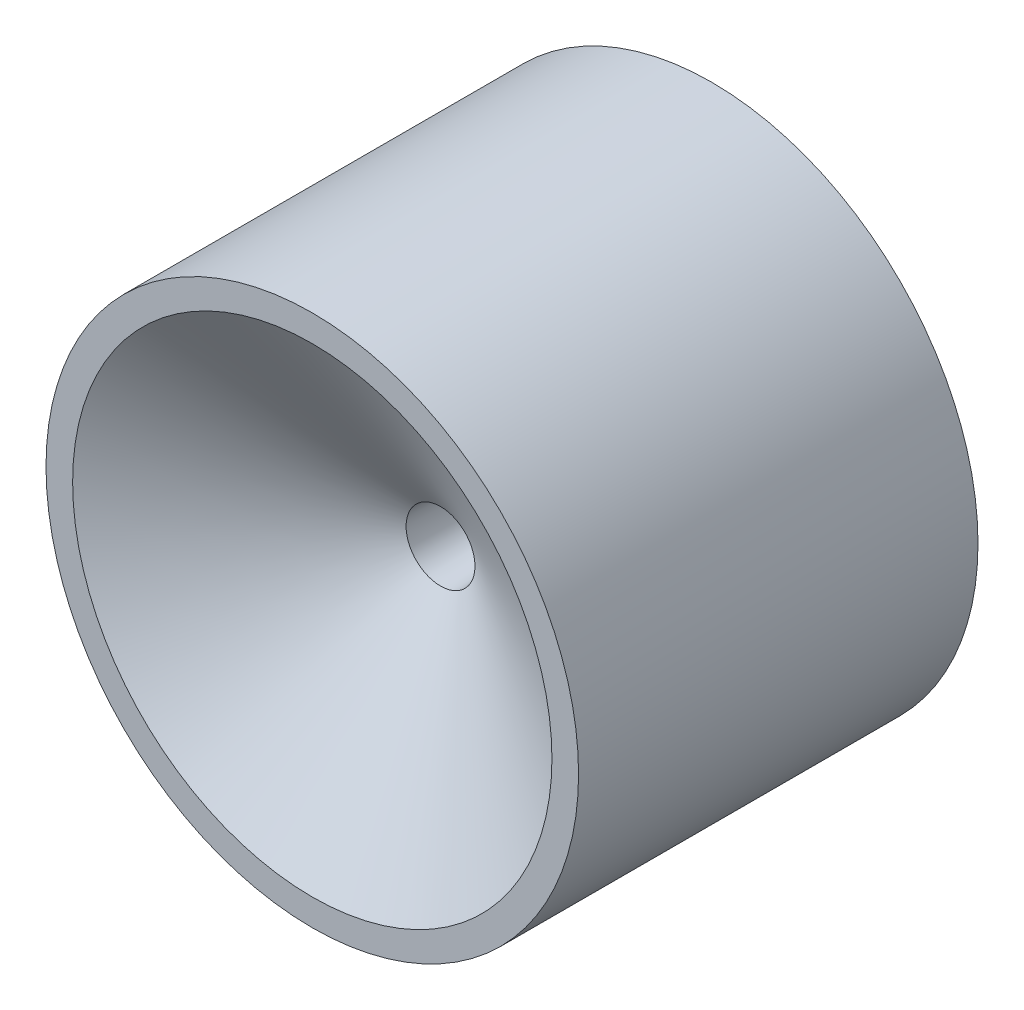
from build123d import *

# Parameters (mm, degrees)
ESQUISSE1_R             = 10
BOSS_EXTRU_1_DEPTH      = 15
ESQUISSE2_R             = 3.4
ENL_V_MAT_EXTRU_1_DEPTH = 8
ESQUISSE3_R             = 1.2
ENL_V_MAT_EXTRU_2_DEPTH = 17.248076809
ENL_V_MAT_EXTRU_2_DRAFT = 2.45
ESQUISSE5_R             = 9
ENL_V_MAT_EXTRU_3_DEPTH = 5
ENL_V_MAT_EXTRU_3_DRAFT = -58
ESQUISSE6_R             = 9
ESQUISSE6_R_2           = 5.5
ENL_V_MAT_EXTRU_4_DEPTH = 12


with BuildPart() as part:
    # Esquisse1 → Boss.-Extru.1 (new body)
    with BuildSketch(Plane.XY):
        Circle(ESQUISSE1_R)
    extrude(amount=BOSS_EXTRU_1_DEPTH)

    # Esquisse2 → Enl_v. mat.-Extru.1 (cut)
    with BuildSketch(Plane.XY):
        Circle(ESQUISSE2_R)
    extrude(amount=ENL_V_MAT_EXTRU_1_DEPTH, mode=Mode.SUBTRACT)


with BuildPart() as enl_v_mat_extru_2_tool:
    # Esquisse3 → Enl_v. mat.-Extru.2 (with draft: the straight prism first)
    with BuildSketch(Plane(origin=(0, 0, 8), x_dir=(-1, 0, 0), z_dir=(0, 0, -1))):
        Circle(ESQUISSE3_R)
    extrude(amount=-ENL_V_MAT_EXTRU_2_DEPTH)
    # Enl_v. mat.-Extru.2: the draft: its side faces are tilted about the plane it starts from
    enl_v_mat_extru_2_sides = [enl_v_mat_extru_2_tool.faces().sort_by_distance(p)[0] for p in [
        (1.2, 0, 16.624038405),
    ]]
    draft(enl_v_mat_extru_2_sides, Plane(origin=(0, 0, 8), x_dir=(-1, 0, 0), z_dir=(0, 0, -1)), ENL_V_MAT_EXTRU_2_DRAFT)


with BuildPart() as part_1:
    add(part.part)

    # Enl_v. mat.-Extru.2: cut by enl_v_mat_extru_2_tool
    add(enl_v_mat_extru_2_tool.part, mode=Mode.SUBTRACT)


with BuildPart() as enl_v_mat_extru_3_tool:
    # Esquisse5 → Enl_v. mat.-Extru.3 (with draft: the straight prism first)
    with BuildSketch(Plane.XY.offset(15)):
        Circle(ESQUISSE5_R)
    extrude(amount=-ENL_V_MAT_EXTRU_3_DEPTH)
    # Enl_v. mat.-Extru.3: the draft: its side faces are tilted about the plane it starts from
    enl_v_mat_extru_3_sides = [enl_v_mat_extru_3_tool.faces().sort_by_distance(p)[0] for p in [
        (-9, 0, 12.5),
    ]]
    draft(enl_v_mat_extru_3_sides, Plane.XY.offset(15), ENL_V_MAT_EXTRU_3_DRAFT)


with BuildPart() as part_2:
    add(part_1.part)

    # Enl_v. mat.-Extru.3: cut by enl_v_mat_extru_3_tool
    add(enl_v_mat_extru_3_tool.part, mode=Mode.SUBTRACT)

    # Esquisse6 → Enl_v. mat.-Extru.4 (cut)
    with BuildSketch(Plane(origin=(0, 0, 0), x_dir=(-1, 0, 0), z_dir=(0, 0, -1))):
        Circle(ESQUISSE6_R)
        Circle(ESQUISSE6_R_2, mode=Mode.SUBTRACT)
    extrude(amount=-ENL_V_MAT_EXTRU_4_DEPTH, mode=Mode.SUBTRACT)


solid = part_2.part
